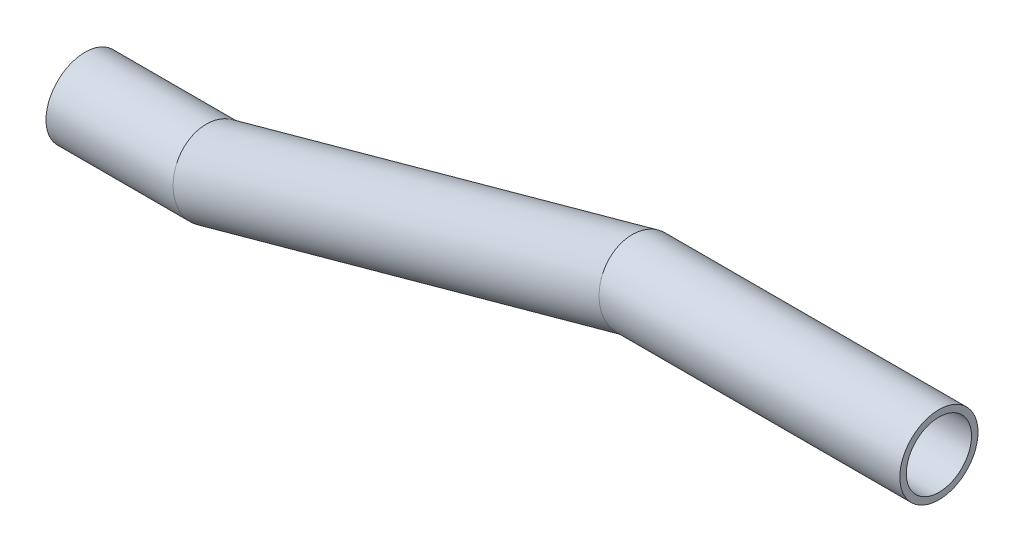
ISO-10303-21;
HEADER;
FILE_DESCRIPTION(('STEP AP214'),'2;1');
FILE_NAME('part.step','',(''),(''),'','','');
FILE_SCHEMA(('AUTOMOTIVE_DESIGN { 1 0 10303 214 1 1 1 1 }'));
ENDSEC;
DATA;
#1=APPLICATION_CONTEXT('core data for automotive mechanical design processes');
#2=APPLICATION_PROTOCOL_DEFINITION('international standard','automotive_design',2000,#1);
#3=PRODUCT_CONTEXT('',#1,'mechanical');
#4=PRODUCT('Part','Part','',(#3));
#5=PRODUCT_RELATED_PRODUCT_CATEGORY('part','',(#4));
#6=PRODUCT_DEFINITION_FORMATION('','',#4);
#7=PRODUCT_DEFINITION_CONTEXT('part definition',#1,'design');
#8=PRODUCT_DEFINITION('design','',#6,#7);
#9=PRODUCT_DEFINITION_SHAPE('','',#8);
#10=(LENGTH_UNIT() NAMED_UNIT(*) SI_UNIT(.MILLI.,.METRE.));
#11=(NAMED_UNIT(*) PLANE_ANGLE_UNIT() SI_UNIT($,.RADIAN.));
#12=(NAMED_UNIT(*) SI_UNIT($,.STERADIAN.) SOLID_ANGLE_UNIT());
#13=UNCERTAINTY_MEASURE_WITH_UNIT(LENGTH_MEASURE(1.E-05),#10,'distance_accuracy_value','');
#14=(GEOMETRIC_REPRESENTATION_CONTEXT(3) GLOBAL_UNCERTAINTY_ASSIGNED_CONTEXT((#13)) GLOBAL_UNIT_ASSIGNED_CONTEXT((#10,
#11,#12)) REPRESENTATION_CONTEXT('',''));
#15=CARTESIAN_POINT('',(0.,0.,0.));
#16=DIRECTION('',(0.,0.,1.));
#17=DIRECTION('',(1.,0.,0.));
#18=AXIS2_PLACEMENT_3D('',#15,#16,#17);
#19=CARTESIAN_POINT('',(-597.,-129.,-38.5));
#20=DIRECTION('',(-1.,0.,0.));
#21=DIRECTION('',(0.,0.,1.));
#22=AXIS2_PLACEMENT_3D('',#19,#20,#21);
#23=CYLINDRICAL_SURFACE('',#22,25.15);
#24=CARTESIAN_POINT('',(-597.,-129.,-38.5));
#25=DIRECTION('',(-0.984588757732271,-0.167581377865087,-0.0500145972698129));
#26=DIRECTION('',(0.174885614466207,-0.943466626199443,-0.281577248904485));
#27=AXIS2_PLACEMENT_3D('',#24,#25,#26);
#28=ELLIPSE('',#27,25.5436595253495,25.15);
#29=CARTESIAN_POINT('',(-592.532781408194,-153.099590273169,-45.6925133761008));
#30=VERTEX_POINT('',#29);
#31=EDGE_CURVE('E45',#30,#30,#28,.T.);
#32=ORIENTED_EDGE('',*,*,#31,.F.);
#33=EDGE_LOOP('',(#32));
#34=FACE_BOUND('',#33,.T.);
#35=CARTESIAN_POINT('',(-697.,-129.,-38.5));
#36=DIRECTION('',(-1.,0.,0.));
#37=DIRECTION('',(0.,0.,1.));
#38=AXIS2_PLACEMENT_3D('',#35,#36,#37);
#39=CIRCLE('',#38,25.15);
#40=CARTESIAN_POINT('',(-697.,-129.,-13.35));
#41=VERTEX_POINT('',#40);
#42=EDGE_CURVE('E11',#41,#41,#39,.F.);
#43=ORIENTED_EDGE('',*,*,#42,.F.);
#44=EDGE_LOOP('',(#43));
#45=FACE_BOUND('',#44,.T.);
#46=ADVANCED_FACE('F29',(#34,#45),#23,.F.);
#47=CARTESIAN_POINT('',(-597.,-129.,-38.5));
#48=DIRECTION('',(-1.,0.,0.));
#49=DIRECTION('',(0.,0.,1.));
#50=AXIS2_PLACEMENT_3D('',#47,#48,#49);
#51=CYLINDRICAL_SURFACE('',#50,30.15);
#52=CARTESIAN_POINT('',(-597.,-129.,-38.5));
#53=DIRECTION('',(-0.984588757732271,-0.167581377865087,-0.0500145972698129));
#54=DIRECTION('',(0.174885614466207,-0.943466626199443,-0.281577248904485));
#55=AXIS2_PLACEMENT_3D('',#52,#53,#54);
#56=ELLIPSE('',#55,30.6219218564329,30.15);
#57=CARTESIAN_POINT('',(-591.644666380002,-157.890761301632,-47.1224365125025));
#58=VERTEX_POINT('',#57);
#59=EDGE_CURVE('E41',#58,#58,#56,.T.);
#60=ORIENTED_EDGE('',*,*,#59,.T.);
#61=EDGE_LOOP('',(#60));
#62=FACE_BOUND('',#61,.T.);
#63=CARTESIAN_POINT('',(-697.,-129.,-38.5));
#64=DIRECTION('',(-1.,0.,0.));
#65=DIRECTION('',(0.,0.,1.));
#66=AXIS2_PLACEMENT_3D('',#63,#64,#65);
#67=CIRCLE('',#66,30.15);
#68=CARTESIAN_POINT('',(-697.,-129.,-8.35000000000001));
#69=VERTEX_POINT('',#68);
#70=EDGE_CURVE('E33',#69,#69,#67,.F.);
#71=ORIENTED_EDGE('',*,*,#70,.T.);
#72=EDGE_LOOP('',(#71));
#73=FACE_BOUND('',#72,.T.);
#74=ADVANCED_FACE('F31',(#62,#73),#51,.T.);
#75=CARTESIAN_POINT('',(-230.,0.,0.));
#76=DIRECTION('',(-0.938830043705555,-0.329997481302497,-0.0984876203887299));
#77=DIRECTION('',(0.33160967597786,-0.943416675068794,0.));
#78=AXIS2_PLACEMENT_3D('',#75,#76,#77);
#79=CYLINDRICAL_SURFACE('',#78,30.15);
#80=CARTESIAN_POINT('',(-230.,0.,0.));
#81=DIRECTION('',(-0.984588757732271,-0.167581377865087,-0.0500145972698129));
#82=DIRECTION('',(0.174885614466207,-0.943466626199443,-0.281577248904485));
#83=AXIS2_PLACEMENT_3D('',#80,#81,#82);
#84=ELLIPSE('',#83,30.6219218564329,30.15);
#85=CARTESIAN_POINT('',(-224.644666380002,-28.8907613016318,-8.62243651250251));
#86=VERTEX_POINT('',#85);
#87=EDGE_CURVE('E49',#86,#86,#84,.F.);
#88=ORIENTED_EDGE('',*,*,#87,.F.);
#89=EDGE_LOOP('',(#88));
#90=FACE_BOUND('',#89,.T.);
#91=ORIENTED_EDGE('',*,*,#59,.F.);
#92=EDGE_LOOP('',(#91));
#93=FACE_BOUND('',#92,.T.);
#94=ADVANCED_FACE('F67',(#90,#93),#79,.T.);
#95=CARTESIAN_POINT('',(-230.,0.,0.));
#96=DIRECTION('',(-0.938830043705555,-0.329997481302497,-0.0984876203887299));
#97=DIRECTION('',(0.33160967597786,-0.943416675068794,0.));
#98=AXIS2_PLACEMENT_3D('',#95,#96,#97);
#99=CYLINDRICAL_SURFACE('',#98,25.15);
#100=CARTESIAN_POINT('',(-230.,0.,0.));
#101=DIRECTION('',(-0.984588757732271,-0.167581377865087,-0.0500145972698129));
#102=DIRECTION('',(0.174885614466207,-0.943466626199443,-0.281577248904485));
#103=AXIS2_PLACEMENT_3D('',#100,#101,#102);
#104=ELLIPSE('',#103,25.5436595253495,25.15);
#105=CARTESIAN_POINT('',(-225.532781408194,-24.0995902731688,-7.19251337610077));
#106=VERTEX_POINT('',#105);
#107=EDGE_CURVE('E46',#106,#106,#104,.F.);
#108=ORIENTED_EDGE('',*,*,#107,.T.);
#109=EDGE_LOOP('',(#108));
#110=FACE_BOUND('',#109,.T.);
#111=ORIENTED_EDGE('',*,*,#31,.T.);
#112=EDGE_LOOP('',(#111));
#113=FACE_BOUND('',#112,.T.);
#114=ADVANCED_FACE('F60',(#110,#113),#99,.F.);
#115=CARTESIAN_POINT('',(-315.277077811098,0.,0.));
#116=DIRECTION('',(1.,0.,0.));
#117=DIRECTION('',(0.,0.,-1.));
#118=AXIS2_PLACEMENT_3D('',#115,#116,#117);
#119=CYLINDRICAL_SURFACE('',#118,25.15);
#120=CARTESIAN_POINT('',(0.,0.,0.));
#121=DIRECTION('',(1.,0.,0.));
#122=DIRECTION('',(0.,0.,-1.));
#123=AXIS2_PLACEMENT_3D('',#120,#121,#122);
#124=CIRCLE('',#123,25.15);
#125=CARTESIAN_POINT('',(0.,0.,-25.15));
#126=VERTEX_POINT('',#125);
#127=EDGE_CURVE('E50',#126,#126,#124,.T.);
#128=ORIENTED_EDGE('',*,*,#127,.T.);
#129=EDGE_LOOP('',(#128));
#130=FACE_BOUND('',#129,.T.);
#131=ORIENTED_EDGE('',*,*,#107,.F.);
#132=EDGE_LOOP('',(#131));
#133=FACE_BOUND('',#132,.T.);
#134=ADVANCED_FACE('F72',(#130,#133),#119,.F.);
#135=CARTESIAN_POINT('',(0.,0.,0.));
#136=DIRECTION('',(1.,0.,0.));
#137=DIRECTION('',(0.,0.,-1.));
#138=AXIS2_PLACEMENT_3D('',#135,#136,#137);
#139=PLANE('',#138);
#140=ORIENTED_EDGE('',*,*,#127,.F.);
#141=EDGE_LOOP('',(#140));
#142=FACE_BOUND('',#141,.T.);
#143=CARTESIAN_POINT('',(0.,0.,0.));
#144=DIRECTION('',(1.,0.,0.));
#145=DIRECTION('',(0.,0.,-1.));
#146=AXIS2_PLACEMENT_3D('',#143,#144,#145);
#147=CIRCLE('',#146,30.15);
#148=CARTESIAN_POINT('',(0.,0.,-30.15));
#149=VERTEX_POINT('',#148);
#150=EDGE_CURVE('E53',#149,#149,#147,.T.);
#151=ORIENTED_EDGE('',*,*,#150,.T.);
#152=EDGE_LOOP('',(#151));
#153=FACE_BOUND('',#152,.T.);
#154=ADVANCED_FACE('F79',(#142,#153),#139,.T.);
#155=CARTESIAN_POINT('',(-315.277077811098,0.,0.));
#156=DIRECTION('',(1.,0.,0.));
#157=DIRECTION('',(0.,0.,-1.));
#158=AXIS2_PLACEMENT_3D('',#155,#156,#157);
#159=CYLINDRICAL_SURFACE('',#158,30.15);
#160=ORIENTED_EDGE('',*,*,#150,.F.);
#161=EDGE_LOOP('',(#160));
#162=FACE_BOUND('',#161,.T.);
#163=ORIENTED_EDGE('',*,*,#87,.T.);
#164=EDGE_LOOP('',(#163));
#165=FACE_BOUND('',#164,.T.);
#166=ADVANCED_FACE('F81',(#162,#165),#159,.T.);
#167=CARTESIAN_POINT('',(-697.,-129.,-38.5));
#168=DIRECTION('',(-1.,0.,0.));
#169=DIRECTION('',(0.,0.,1.));
#170=AXIS2_PLACEMENT_3D('',#167,#168,#169);
#171=PLANE('',#170);
#172=ORIENTED_EDGE('',*,*,#70,.F.);
#173=EDGE_LOOP('',(#172));
#174=FACE_BOUND('',#173,.T.);
#175=ORIENTED_EDGE('',*,*,#42,.T.);
#176=EDGE_LOOP('',(#175));
#177=FACE_BOUND('',#176,.T.);
#178=ADVANCED_FACE('F84',(#174,#177),#171,.T.);
#179=CLOSED_SHELL('',(#46,#74,#94,#114,#134,#154,#166,#178));
#180=MANIFOLD_SOLID_BREP('B2',#179);
#181=ADVANCED_BREP_SHAPE_REPRESENTATION('',(#18,#180),#14);
#182=SHAPE_DEFINITION_REPRESENTATION(#9,#181);
ENDSEC;
END-ISO-10303-21;
